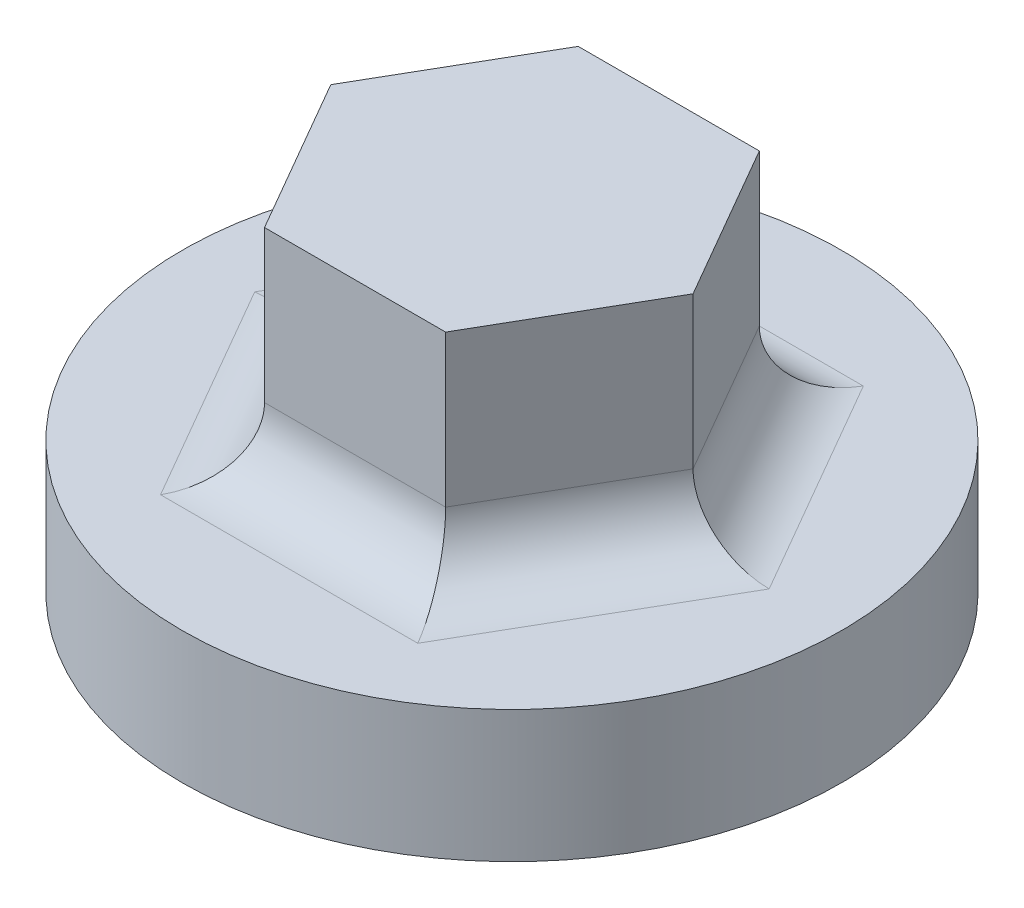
from build123d import *

# Parameters (mm, degrees)
SKETCH1_R      = 50
EXTRUDE1_DEPTH = 20
EXTRUDE2_DEPTH = 33
FILLET3_R      = 10


with BuildPart() as part:
    # Sketch1 → Extrude1 (new body)
    with BuildSketch(Plane(origin=(0, 0, 0), x_dir=(1, 0, 0), z_dir=(0, 1, 0))):
        with Locations(Location((0, 0, 0), (0, 0, 270))):
            Circle(SKETCH1_R)
    extrude(amount=EXTRUDE1_DEPTH)

    # Sketch2 → Extrude2 (add)
    with BuildSketch(Plane(origin=(0, 20, 0), x_dir=(-1, 0, 0), z_dir=(0, 1, 0))):
        Polygon((27.4794744, 0), (13.7397372, 23.797922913), (-13.7397372, 23.797922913), (-27.4794744, 0), (-13.7397372, -23.797922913), (13.7397372, -23.797922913), align=None)
    extrude(amount=EXTRUDE2_DEPTH)

    # Fillet3
    fillet3_edges = [part.edges().sort_by_distance(p)[0] for p in [
        (0, 20, -23.797922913),
        (-20.6096058, 20, -11.898961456),
        (-20.6096058, 20, 11.898961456),
        (0, 20, 23.797922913),
        (20.6096058, 20, 11.898961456),
        (20.6096058, 20, -11.898961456),
    ]]
    fillet(fillet3_edges, radius=FILLET3_R)


solid = part.part
